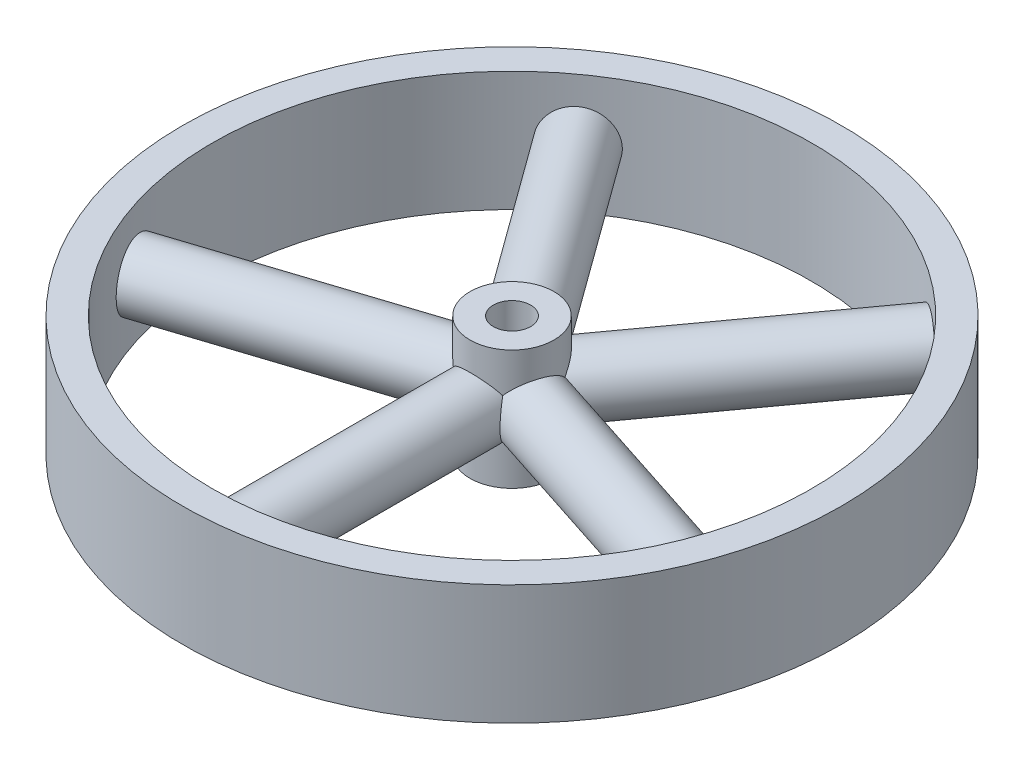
from build123d import *

# Parameters (mm, degrees)
SKETCH1_R           = 69.85
SKETCH1_R_2         = 63.5
EXTRUDE_THIN1_DEPTH = 12.7
SKETCH2_R           = 8.895106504
EXTRUDE2_DEPTH      = 12.7
EXTRUDE3_REACH      = 101.596
EXTRUDE3_END_RADIUS = 63.5
SKETCH3_R           = 6.745090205
CIRPATTERN2_COUNT   = 5
SKETCH4_R           = 3.961678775
CUT_EXTRUDE1_DEPTH  = 102.996102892


with BuildPart() as part:
    # Sketch1 → Extrude-Thin1 (new, symmetric)
    with BuildSketch(Plane(origin=(0, 0, 0), x_dir=(1, 0, 0), z_dir=(0, 1, 0))):
        Circle(SKETCH1_R)
        Circle(SKETCH1_R_2, mode=Mode.SUBTRACT)
    extrude(amount=EXTRUDE_THIN1_DEPTH, both=True)


with BuildPart() as body_2:
    # Sketch2 → Extrude2 (new, symmetric)
    with BuildSketch(Plane(origin=(0, 0, 0), x_dir=(1, 0, 0), z_dir=(0, 1, 0))):
        with Locations(Location((0, 0, 0), (0, 0, 270))):
            Circle(SKETCH2_R)
    extrude(amount=EXTRUDE2_DEPTH, both=True)

    # Extrude3: up to this cylinder (the profile starts inside it)
    extrude3_end = Plane(origin=(0, 0, 0), z_dir=(0, -1, 0)) * Cylinder(EXTRUDE3_END_RADIUS, 331.192, mode=Mode.PRIVATE)
    # Sketch3 → Extrude3 (add, up to the surface)
    with BuildSketch(Plane.XY, mode=Mode.PRIVATE) as extrude3_sk1:
        with Locations(Location((0, 0, 0), (0, 0, 180))):
            Circle(SKETCH3_R)
    extrude3_tool1 = extrude(extrude3_sk1.sketch, amount=EXTRUDE3_REACH, mode=Mode.PRIVATE) & extrude3_end
    extrude3 = extrude3_tool1.solids().sort_by_distance((0, 0, 0))[0]
    add(extrude3)


with BuildPart() as part_1:
    add(part.part)

    add(body_2.part)  # CirPattern2 merges body 2
    # CirPattern2: Extrude3 ×5 about axis
    cirpattern2_axis = Axis((0, 12.7, 0), (0, -1, 0))
    for i in range(1, CIRPATTERN2_COUNT):
        add(extrude3.rotate(cirpattern2_axis, i * 360 / CIRPATTERN2_COUNT))

    # Sketch4 → Cut-Extrude1 (cut, through all)
    with BuildSketch(Plane(origin=(0, 12.7, 0), x_dir=(-1, 0, 0), z_dir=(0, 1, 0))):
        with Locations(Location((0, 0, 0), (0, 0, 90))):
            Circle(SKETCH4_R)
    extrude(amount=-CUT_EXTRUDE1_DEPTH, mode=Mode.SUBTRACT)


solid = part_1.part
